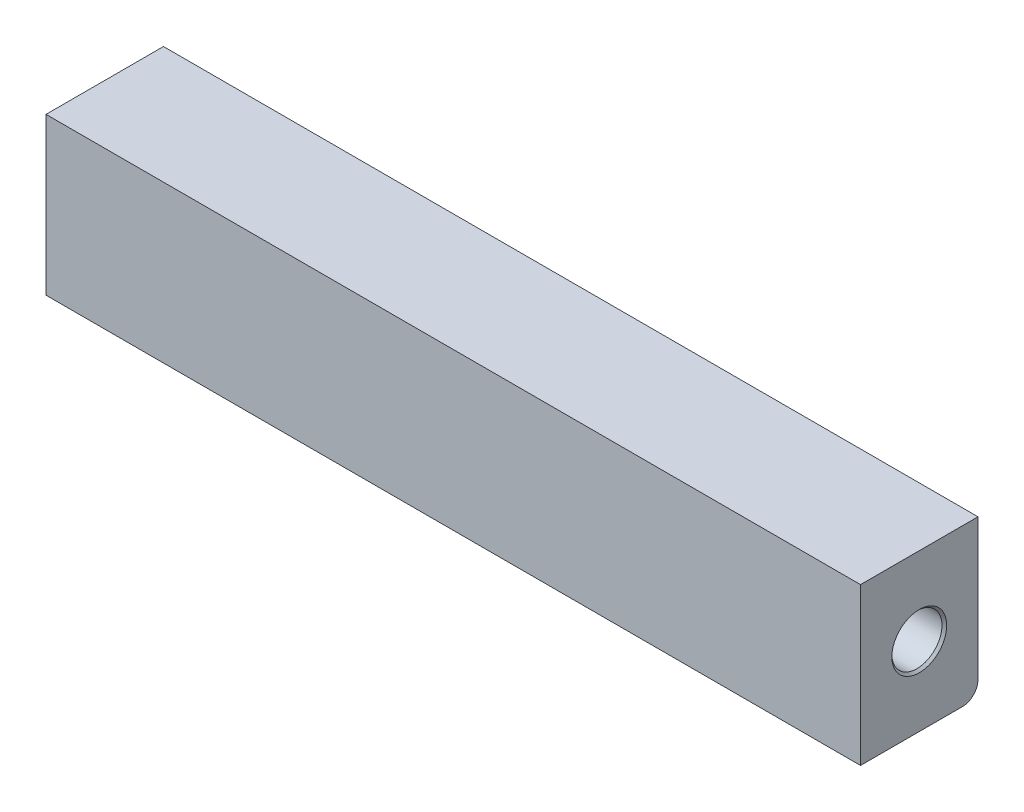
ISO-10303-21;
HEADER;
FILE_DESCRIPTION(('STEP AP214'),'2;1');
FILE_NAME('part.step','',(''),(''),'','','');
FILE_SCHEMA(('AUTOMOTIVE_DESIGN { 1 0 10303 214 1 1 1 1 }'));
ENDSEC;
DATA;
#1=APPLICATION_CONTEXT('core data for automotive mechanical design processes');
#2=APPLICATION_PROTOCOL_DEFINITION('international standard','automotive_design',2000,#1);
#3=PRODUCT_CONTEXT('',#1,'mechanical');
#4=PRODUCT('Part','Part','',(#3));
#5=PRODUCT_RELATED_PRODUCT_CATEGORY('part','',(#4));
#6=PRODUCT_DEFINITION_FORMATION('','',#4);
#7=PRODUCT_DEFINITION_CONTEXT('part definition',#1,'design');
#8=PRODUCT_DEFINITION('design','',#6,#7);
#9=PRODUCT_DEFINITION_SHAPE('','',#8);
#10=(LENGTH_UNIT() NAMED_UNIT(*) SI_UNIT(.MILLI.,.METRE.));
#11=(NAMED_UNIT(*) PLANE_ANGLE_UNIT() SI_UNIT($,.RADIAN.));
#12=(NAMED_UNIT(*) SI_UNIT($,.STERADIAN.) SOLID_ANGLE_UNIT());
#13=UNCERTAINTY_MEASURE_WITH_UNIT(LENGTH_MEASURE(1.E-05),#10,'distance_accuracy_value','');
#14=(GEOMETRIC_REPRESENTATION_CONTEXT(3) GLOBAL_UNCERTAINTY_ASSIGNED_CONTEXT((#13)) GLOBAL_UNIT_ASSIGNED_CONTEXT((#10,
#11,#12)) REPRESENTATION_CONTEXT('',''));
#15=CARTESIAN_POINT('',(0.,0.,0.));
#16=DIRECTION('',(0.,0.,1.));
#17=DIRECTION('',(1.,0.,0.));
#18=AXIS2_PLACEMENT_3D('',#15,#16,#17);
#19=CARTESIAN_POINT('',(52.,20.,-7.50000000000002));
#20=DIRECTION('',(-1.,0.,0.));
#21=DIRECTION('',(0.,0.,1.));
#22=AXIS2_PLACEMENT_3D('',#19,#20,#21);
#23=PLANE('',#22);
#24=CARTESIAN_POINT('',(52.,9.99999999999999,0.));
#25=DIRECTION('',(1.,0.,0.));
#26=DIRECTION('',(0.,0.,-1.));
#27=AXIS2_PLACEMENT_3D('',#24,#25,#26);
#28=CIRCLE('',#27,3.5);
#29=CARTESIAN_POINT('',(52.,9.99999999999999,-3.5));
#30=VERTEX_POINT('',#29);
#31=EDGE_CURVE('E99',#30,#30,#28,.T.);
#32=ORIENTED_EDGE('',*,*,#31,.F.);
#33=EDGE_LOOP('',(#32));
#34=FACE_BOUND('',#33,.T.);
#35=DIRECTION('',(0.,0.,-1.));
#36=VECTOR('',#35,1.);
#37=CARTESIAN_POINT('',(52.,0.,-7.50000000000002));
#38=LINE('',#37,#36);
#39=CARTESIAN_POINT('',(52.,0.,7.50000000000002));
#40=VERTEX_POINT('',#39);
#41=CARTESIAN_POINT('',(52.,0.,-5.50000000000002));
#42=VERTEX_POINT('',#41);
#43=EDGE_CURVE('E108',#40,#42,#38,.T.);
#44=ORIENTED_EDGE('',*,*,#43,.T.);
#45=CARTESIAN_POINT('',(52.,2.,-5.50000000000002));
#46=DIRECTION('',(-1.,0.,0.));
#47=DIRECTION('',(0.,0.,1.));
#48=AXIS2_PLACEMENT_3D('',#45,#46,#47);
#49=CIRCLE('',#48,2.);
#50=CARTESIAN_POINT('',(52.,2.,-7.50000000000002));
#51=VERTEX_POINT('',#50);
#52=EDGE_CURVE('E11',#42,#51,#49,.F.);
#53=ORIENTED_EDGE('',*,*,#52,.T.);
#54=DIRECTION('',(0.,-1.,0.));
#55=VECTOR('',#54,1.);
#56=CARTESIAN_POINT('',(52.,20.,-7.50000000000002));
#57=LINE('',#56,#55);
#58=CARTESIAN_POINT('',(52.,20.,-7.50000000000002));
#59=VERTEX_POINT('',#58);
#60=EDGE_CURVE('E131',#59,#51,#57,.T.);
#61=ORIENTED_EDGE('',*,*,#60,.F.);
#62=DIRECTION('',(0.,0.,-1.));
#63=VECTOR('',#62,1.);
#64=CARTESIAN_POINT('',(52.,20.,-7.50000000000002));
#65=LINE('',#64,#63);
#66=CARTESIAN_POINT('',(52.,20.,7.50000000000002));
#67=VERTEX_POINT('',#66);
#68=EDGE_CURVE('E109',#67,#59,#65,.T.);
#69=ORIENTED_EDGE('',*,*,#68,.F.);
#70=DIRECTION('',(0.,-1.,0.));
#71=VECTOR('',#70,1.);
#72=CARTESIAN_POINT('',(52.,20.,7.50000000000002));
#73=LINE('',#72,#71);
#74=EDGE_CURVE('E119',#67,#40,#73,.T.);
#75=ORIENTED_EDGE('',*,*,#74,.T.);
#76=EDGE_LOOP('',(#44,#53,#61,#69,#75));
#77=FACE_BOUND('',#76,.T.);
#78=ADVANCED_FACE('F32',(#34,#77),#23,.F.);
#79=CARTESIAN_POINT('',(-52.,20.,-7.50000000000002));
#80=DIRECTION('',(0.,0.,1.));
#81=DIRECTION('',(1.,0.,0.));
#82=AXIS2_PLACEMENT_3D('',#79,#80,#81);
#83=PLANE('',#82);
#84=ORIENTED_EDGE('',*,*,#60,.T.);
#85=DIRECTION('',(-1.,0.,0.));
#86=VECTOR('',#85,1.);
#87=CARTESIAN_POINT('',(-52.,2.,-7.50000000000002));
#88=LINE('',#87,#86);
#89=CARTESIAN_POINT('',(-52.,2.,-7.50000000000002));
#90=VERTEX_POINT('',#89);
#91=EDGE_CURVE('E134',#51,#90,#88,.T.);
#92=ORIENTED_EDGE('',*,*,#91,.T.);
#93=DIRECTION('',(0.,-1.,0.));
#94=VECTOR('',#93,1.);
#95=CARTESIAN_POINT('',(-52.,20.,-7.50000000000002));
#96=LINE('',#95,#94);
#97=CARTESIAN_POINT('',(-52.,20.,-7.50000000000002));
#98=VERTEX_POINT('',#97);
#99=EDGE_CURVE('E129',#98,#90,#96,.T.);
#100=ORIENTED_EDGE('',*,*,#99,.F.);
#101=DIRECTION('',(-1.,0.,0.));
#102=VECTOR('',#101,1.);
#103=CARTESIAN_POINT('',(-52.,20.,-7.50000000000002));
#104=LINE('',#103,#102);
#105=EDGE_CURVE('E112',#59,#98,#104,.T.);
#106=ORIENTED_EDGE('',*,*,#105,.F.);
#107=EDGE_LOOP('',(#84,#92,#100,#106));
#108=FACE_BOUND('',#107,.T.);
#109=ADVANCED_FACE('F140',(#108),#83,.F.);
#110=CARTESIAN_POINT('',(-52.,20.,-7.50000000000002));
#111=DIRECTION('',(1.,0.,0.));
#112=DIRECTION('',(0.,0.,-1.));
#113=AXIS2_PLACEMENT_3D('',#110,#111,#112);
#114=PLANE('',#113);
#115=CARTESIAN_POINT('',(-52.,10.,0.));
#116=DIRECTION('',(-1.,0.,0.));
#117=DIRECTION('',(0.,0.,1.));
#118=AXIS2_PLACEMENT_3D('',#115,#116,#117);
#119=CIRCLE('',#118,3.5);
#120=CARTESIAN_POINT('',(-52.,10.,3.5));
#121=VERTEX_POINT('',#120);
#122=EDGE_CURVE('E92',#121,#121,#119,.T.);
#123=ORIENTED_EDGE('',*,*,#122,.F.);
#124=EDGE_LOOP('',(#123));
#125=FACE_BOUND('',#124,.T.);
#126=ORIENTED_EDGE('',*,*,#99,.T.);
#127=CARTESIAN_POINT('',(-52.,2.,-5.50000000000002));
#128=DIRECTION('',(1.,0.,0.));
#129=DIRECTION('',(0.,0.,-1.));
#130=AXIS2_PLACEMENT_3D('',#127,#128,#129);
#131=CIRCLE('',#130,2.);
#132=CARTESIAN_POINT('',(-52.,0.,-5.50000000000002));
#133=VERTEX_POINT('',#132);
#134=EDGE_CURVE('E54',#90,#133,#131,.F.);
#135=ORIENTED_EDGE('',*,*,#134,.T.);
#136=DIRECTION('',(0.,0.,1.));
#137=VECTOR('',#136,1.);
#138=CARTESIAN_POINT('',(-52.,0.,-7.50000000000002));
#139=LINE('',#138,#137);
#140=CARTESIAN_POINT('',(-52.,0.,7.50000000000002));
#141=VERTEX_POINT('',#140);
#142=EDGE_CURVE('E121',#133,#141,#139,.T.);
#143=ORIENTED_EDGE('',*,*,#142,.T.);
#144=DIRECTION('',(0.,-1.,0.));
#145=VECTOR('',#144,1.);
#146=CARTESIAN_POINT('',(-52.,20.,7.50000000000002));
#147=LINE('',#146,#145);
#148=CARTESIAN_POINT('',(-52.,20.,7.50000000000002));
#149=VERTEX_POINT('',#148);
#150=EDGE_CURVE('E126',#149,#141,#147,.T.);
#151=ORIENTED_EDGE('',*,*,#150,.F.);
#152=DIRECTION('',(0.,0.,1.));
#153=VECTOR('',#152,1.);
#154=CARTESIAN_POINT('',(-52.,20.,-7.50000000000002));
#155=LINE('',#154,#153);
#156=EDGE_CURVE('E115',#98,#149,#155,.T.);
#157=ORIENTED_EDGE('',*,*,#156,.F.);
#158=EDGE_LOOP('',(#126,#135,#143,#151,#157));
#159=FACE_BOUND('',#158,.T.);
#160=ADVANCED_FACE('F145',(#125,#159),#114,.F.);
#161=CARTESIAN_POINT('',(-52.,20.,7.50000000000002));
#162=DIRECTION('',(0.,0.,-1.));
#163=DIRECTION('',(-1.,0.,0.));
#164=AXIS2_PLACEMENT_3D('',#161,#162,#163);
#165=PLANE('',#164);
#166=DIRECTION('',(1.,0.,0.));
#167=VECTOR('',#166,1.);
#168=CARTESIAN_POINT('',(-52.,0.,7.50000000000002));
#169=LINE('',#168,#167);
#170=EDGE_CURVE('E113',#141,#40,#169,.T.);
#171=ORIENTED_EDGE('',*,*,#170,.T.);
#172=ORIENTED_EDGE('',*,*,#74,.F.);
#173=DIRECTION('',(1.,0.,0.));
#174=VECTOR('',#173,1.);
#175=CARTESIAN_POINT('',(-52.,20.,7.50000000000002));
#176=LINE('',#175,#174);
#177=EDGE_CURVE('E117',#149,#67,#176,.T.);
#178=ORIENTED_EDGE('',*,*,#177,.F.);
#179=ORIENTED_EDGE('',*,*,#150,.T.);
#180=EDGE_LOOP('',(#171,#172,#178,#179));
#181=FACE_BOUND('',#180,.T.);
#182=ADVANCED_FACE('F174',(#181),#165,.F.);
#183=CARTESIAN_POINT('',(0.,20.,0.));
#184=DIRECTION('',(0.,1.,0.));
#185=DIRECTION('',(0.,0.,1.));
#186=AXIS2_PLACEMENT_3D('',#183,#184,#185);
#187=PLANE('',#186);
#188=ORIENTED_EDGE('',*,*,#68,.T.);
#189=ORIENTED_EDGE('',*,*,#105,.T.);
#190=ORIENTED_EDGE('',*,*,#156,.T.);
#191=ORIENTED_EDGE('',*,*,#177,.T.);
#192=EDGE_LOOP('',(#188,#189,#190,#191));
#193=FACE_BOUND('',#192,.T.);
#194=ADVANCED_FACE('F149',(#193),#187,.T.);
#195=CARTESIAN_POINT('',(0.,0.,0.));
#196=DIRECTION('',(0.,1.,0.));
#197=DIRECTION('',(0.,0.,1.));
#198=AXIS2_PLACEMENT_3D('',#195,#196,#197);
#199=PLANE('',#198);
#200=ORIENTED_EDGE('',*,*,#142,.F.);
#201=DIRECTION('',(-1.,0.,0.));
#202=VECTOR('',#201,1.);
#203=CARTESIAN_POINT('',(0.,0.,-5.50000000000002));
#204=LINE('',#203,#202);
#205=EDGE_CURVE('E40',#133,#42,#204,.F.);
#206=ORIENTED_EDGE('',*,*,#205,.T.);
#207=ORIENTED_EDGE('',*,*,#43,.F.);
#208=ORIENTED_EDGE('',*,*,#170,.F.);
#209=EDGE_LOOP('',(#200,#206,#207,#208));
#210=FACE_BOUND('',#209,.T.);
#211=ADVANCED_FACE('F155',(#210),#199,.F.);
#212=CARTESIAN_POINT('',(-52.,2.,-5.50000000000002));
#213=DIRECTION('',(-1.,0.,0.));
#214=DIRECTION('',(0.,0.,1.));
#215=AXIS2_PLACEMENT_3D('',#212,#213,#214);
#216=CYLINDRICAL_SURFACE('',#215,2.);
#217=ORIENTED_EDGE('',*,*,#52,.F.);
#218=ORIENTED_EDGE('',*,*,#205,.F.);
#219=ORIENTED_EDGE('',*,*,#134,.F.);
#220=ORIENTED_EDGE('',*,*,#91,.F.);
#221=EDGE_LOOP('',(#217,#218,#219,#220));
#222=FACE_BOUND('',#221,.T.);
#223=ADVANCED_FACE('F34',(#222),#216,.T.);
#224=CARTESIAN_POINT('',(-22.,10.,0.));
#225=DIRECTION('',(-1.,0.,0.));
#226=DIRECTION('',(0.,0.,1.));
#227=AXIS2_PLACEMENT_3D('',#224,#225,#226);
#228=CONICAL_SURFACE('',#227,3.19999999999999,1.02974425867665);
#229=CARTESIAN_POINT('',(-20.0772460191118,9.99999999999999,0.));
#230=VERTEX_POINT('',#229);
#231=VERTEX_LOOP('',#230);
#232=FACE_BOUND('',#231,.T.);
#233=CARTESIAN_POINT('',(-22.,10.,0.));
#234=DIRECTION('',(-1.,0.,0.));
#235=DIRECTION('',(0.,0.,1.));
#236=AXIS2_PLACEMENT_3D('',#233,#234,#235);
#237=CIRCLE('',#236,3.19999999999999);
#238=CARTESIAN_POINT('',(-22.,10.,3.19999999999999));
#239=VERTEX_POINT('',#238);
#240=EDGE_CURVE('E105',#239,#239,#237,.T.);
#241=ORIENTED_EDGE('',*,*,#240,.T.);
#242=EDGE_LOOP('',(#241));
#243=FACE_BOUND('',#242,.T.);
#244=ADVANCED_FACE('F154',(#232,#243),#228,.F.);
#245=CARTESIAN_POINT('',(-52.,10.,0.));
#246=DIRECTION('',(-1.,0.,0.));
#247=DIRECTION('',(0.,0.,1.));
#248=AXIS2_PLACEMENT_3D('',#245,#246,#247);
#249=CYLINDRICAL_SURFACE('',#248,3.19999999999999);
#250=ORIENTED_EDGE('',*,*,#240,.F.);
#251=EDGE_LOOP('',(#250));
#252=FACE_BOUND('',#251,.T.);
#253=CARTESIAN_POINT('',(-51.7,10.,0.));
#254=DIRECTION('',(-1.,0.,0.));
#255=DIRECTION('',(0.,0.,1.));
#256=AXIS2_PLACEMENT_3D('',#253,#254,#255);
#257=CIRCLE('',#256,3.2);
#258=CARTESIAN_POINT('',(-51.7,10.,3.2));
#259=VERTEX_POINT('',#258);
#260=EDGE_CURVE('E96',#259,#259,#257,.T.);
#261=ORIENTED_EDGE('',*,*,#260,.T.);
#262=EDGE_LOOP('',(#261));
#263=FACE_BOUND('',#262,.T.);
#264=ADVANCED_FACE('F160',(#252,#263),#249,.F.);
#265=CARTESIAN_POINT('',(-52.,10.,0.));
#266=DIRECTION('',(-1.,0.,0.));
#267=DIRECTION('',(0.,0.,1.));
#268=AXIS2_PLACEMENT_3D('',#265,#266,#267);
#269=CONICAL_SURFACE('',#268,3.5,0.785398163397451);
#270=ORIENTED_EDGE('',*,*,#260,.F.);
#271=EDGE_LOOP('',(#270));
#272=FACE_BOUND('',#271,.T.);
#273=ORIENTED_EDGE('',*,*,#122,.T.);
#274=EDGE_LOOP('',(#273));
#275=FACE_BOUND('',#274,.T.);
#276=ADVANCED_FACE('F86',(#272,#275),#269,.F.);
#277=CARTESIAN_POINT('',(22.,9.99999999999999,0.));
#278=DIRECTION('',(1.,0.,0.));
#279=DIRECTION('',(0.,0.,-1.));
#280=AXIS2_PLACEMENT_3D('',#277,#278,#279);
#281=CONICAL_SURFACE('',#280,3.19999999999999,1.02974425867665);
#282=CARTESIAN_POINT('',(20.0772460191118,9.99999999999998,0.));
#283=VERTEX_POINT('',#282);
#284=VERTEX_LOOP('',#283);
#285=FACE_BOUND('',#284,.T.);
#286=CARTESIAN_POINT('',(22.,9.99999999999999,0.));
#287=DIRECTION('',(1.,0.,0.));
#288=DIRECTION('',(0.,0.,-1.));
#289=AXIS2_PLACEMENT_3D('',#286,#287,#288);
#290=CIRCLE('',#289,3.19999999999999);
#291=CARTESIAN_POINT('',(22.,9.99999999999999,-3.19999999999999));
#292=VERTEX_POINT('',#291);
#293=EDGE_CURVE('E90',#292,#292,#290,.T.);
#294=ORIENTED_EDGE('',*,*,#293,.T.);
#295=EDGE_LOOP('',(#294));
#296=FACE_BOUND('',#295,.T.);
#297=ADVANCED_FACE('F82',(#285,#296),#281,.F.);
#298=CARTESIAN_POINT('',(52.,9.99999999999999,0.));
#299=DIRECTION('',(1.,0.,0.));
#300=DIRECTION('',(0.,0.,-1.));
#301=AXIS2_PLACEMENT_3D('',#298,#299,#300);
#302=CYLINDRICAL_SURFACE('',#301,3.19999999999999);
#303=ORIENTED_EDGE('',*,*,#293,.F.);
#304=EDGE_LOOP('',(#303));
#305=FACE_BOUND('',#304,.T.);
#306=CARTESIAN_POINT('',(51.7,9.99999999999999,0.));
#307=DIRECTION('',(1.,0.,0.));
#308=DIRECTION('',(0.,0.,-1.));
#309=AXIS2_PLACEMENT_3D('',#306,#307,#308);
#310=CIRCLE('',#309,3.19999999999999);
#311=CARTESIAN_POINT('',(51.7,9.99999999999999,-3.19999999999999));
#312=VERTEX_POINT('',#311);
#313=EDGE_CURVE('E93',#312,#312,#310,.T.);
#314=ORIENTED_EDGE('',*,*,#313,.T.);
#315=EDGE_LOOP('',(#314));
#316=FACE_BOUND('',#315,.T.);
#317=ADVANCED_FACE('F85',(#305,#316),#302,.F.);
#318=CARTESIAN_POINT('',(52.,9.99999999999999,0.));
#319=DIRECTION('',(1.,0.,0.));
#320=DIRECTION('',(0.,0.,-1.));
#321=AXIS2_PLACEMENT_3D('',#318,#319,#320);
#322=CONICAL_SURFACE('',#321,3.5,0.785398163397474);
#323=ORIENTED_EDGE('',*,*,#313,.F.);
#324=EDGE_LOOP('',(#323));
#325=FACE_BOUND('',#324,.T.);
#326=ORIENTED_EDGE('',*,*,#31,.T.);
#327=EDGE_LOOP('',(#326));
#328=FACE_BOUND('',#327,.T.);
#329=ADVANCED_FACE('F189',(#325,#328),#322,.F.);
#330=CLOSED_SHELL('',(#78,#109,#160,#182,#194,#211,#223,#244,#264,#276,#297,#317,#329));
#331=MANIFOLD_SOLID_BREP('B2',#330);
#332=ADVANCED_BREP_SHAPE_REPRESENTATION('',(#18,#331),#14);
#333=SHAPE_DEFINITION_REPRESENTATION(#9,#332);
ENDSEC;
END-ISO-10303-21;
